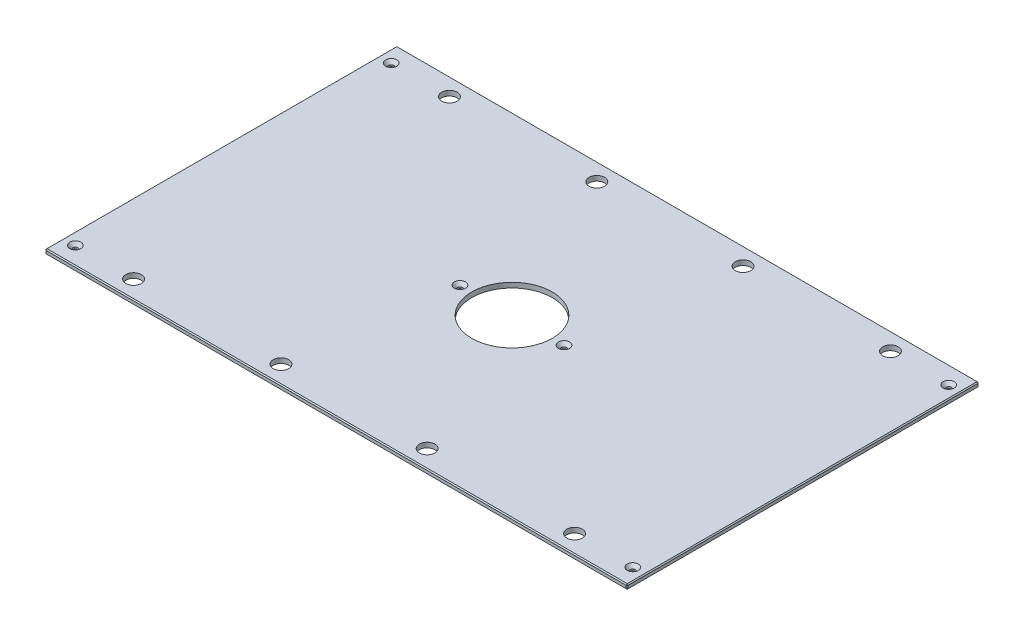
from build123d import *

# Parameters (mm, degrees)
SKETCH1_W                                     = 746.125
SKETCH1_H                                     = 450.85
BOSS_EXTRUDE1_DEPTH                           = 6.35
SKETCH13_R                                    = 51.562
CUT_EXTRUDE6_DEPTH                            = 436.927037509
F_25_32_0_78125_DIAMETER_HOLE1_D              = 19.84375
CHAMFER2_SIZE                                 = 1.27
CSK_FOR_1_4_FLAT_HEAD_MACHINE_SCREW1_AT_COUNT = 2
CSK_FOR_1_4_FLAT_HEAD_MACHINE_SCREW1_AT_PITCH = 404.80996
CSK_FOR_1_4_FLAT_HEAD_MACHINE_SCREW1_2_COUNT  = 2
CSK_FOR_1_4_FLAT_HEAD_MACHINE_SCREW1_2_PITCH  = 821.098498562
CSK_FOR_1_4_FLAT_HEAD_MACHINE_SCREW1_3_COUNT  = 2
CSK_FOR_1_4_FLAT_HEAD_MACHINE_SCREW1_3_PITCH  = 469.709692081
CSK_FOR_1_4_FLAT_HEAD_MACHINE_SCREW1_4_COUNT  = 2
CSK_FOR_1_4_FLAT_HEAD_MACHINE_SCREW1_4_PITCH  = 354.069609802
CSK_FOR_1_4_FLAT_HEAD_MACHINE_SCREW1_5_COUNT  = 2
CSK_FOR_1_4_FLAT_HEAD_MACHINE_SCREW1_5_PITCH  = 714.375
CSK_FOR_1_4_FLAT_HEAD_MACHINE_SCREW1_6_COUNT  = 2
CSK_FOR_1_4_FLAT_HEAD_MACHINE_SCREW1_6_PITCH  = 639.7625
CSK_FOR_1_4_FLAT_HEAD_MACHINE_SCREW1_7_COUNT  = 2
CSK_FOR_1_4_FLAT_HEAD_MACHINE_SCREW1_7_PITCH  = 757.078040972


with BuildPart() as part:
    # Sketch1 → Boss-Extrude1 (new body)
    with BuildSketch(Plane(origin=(0, 0, 0), x_dir=(1, 0, 0), z_dir=(0, 1, 0))):
        Rectangle(SKETCH1_W, SKETCH1_H)
    extrude(amount=BOSS_EXTRUDE1_DEPTH)

    # Sketch13 → Cut-Extrude6 (cut, through all)
    with BuildSketch(Plane(origin=(0, 6.35, 0), x_dir=(1, 0, 0), z_dir=(0, 1, 0))):
        with Locations(Location((0, 0, 0), (0, 0, 270))):
            Circle(SKETCH13_R)
    extrude(amount=-CUT_EXTRUDE6_DEPTH, mode=Mode.SUBTRACT)

    # 25_32 _0.78125_ Diameter Hole1 (through all)
    with Locations(Plane(origin=(0, 6.35, 0), x_dir=(1, 0, 0), z_dir=(0, 1, 0))):
        with Locations((282.575, 202.40498), (-282.575, 202.40498), (282.575, -202.40498), (-282.575, -202.40498), (-93.6625, 202.40498), (93.6625, 202.40498), (93.6625, -202.40498), (-93.6625, -202.40498)):
            Hole(F_25_32_0_78125_DIAMETER_HOLE1_D / 2)

    # Chamfer2
    chamfer2_edges = [part.edges().sort_by_distance(p)[0] for p in [
        (373.0625, 6.35, 0),
        (0, 6.35, -225.425),
        (-373.0625, 6.35, 0),
        (0, 0, -225.425),
        (373.0625, 0, 0),
        (0, 0, 225.425),
        (-373.0625, 0, 0),
        (0, 6.35, 225.425),
        (-373.0625, 3.175, -225.425),
        (373.0625, 3.175, -225.425),
        (373.0625, 3.175, 225.425),
        (-373.0625, 3.175, 225.425),
    ]]
    chamfer(chamfer2_edges, length=CHAMFER2_SIZE)

    # Sketch24 → CSK for 1_4 Flat Head Machine Screw1 (revolve, cut)
    with BuildSketch(Plane(origin=(357.1875, 6.35, -202.40498), x_dir=(0, 0, 1), z_dir=(1, 0, 0))):
        Polygon((0, 0), (0, 6.35), (3.3782, 6.35), (3.3782, 4.324464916), (7.1374, 0), align=None)
    csk_for_1_4_flat_head_machine_screw1 = revolve(axis=Axis((357.1875, 12.7, -202.40498), (0, -1, 0)), mode=Mode.SUBTRACT)

    # CSK for 1_4 Flat Head Machine Screw1 at: CSK for 1_4 Flat Head Machine Screw1 ×2
    with Locations(*[(0, 0, i * CSK_FOR_1_4_FLAT_HEAD_MACHINE_SCREW1_AT_PITCH) for i in range(1, CSK_FOR_1_4_FLAT_HEAD_MACHINE_SCREW1_AT_COUNT)]):
        add(csk_for_1_4_flat_head_machine_screw1, mode=Mode.SUBTRACT)

    # CSK for 1_4 Flat Head Machine Screw1 2: CSK for 1_4 Flat Head Machine Screw1 ×2
    with Locations(*[Vector(-0.8700235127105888, 0, 0.49301023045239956) * (i * CSK_FOR_1_4_FLAT_HEAD_MACHINE_SCREW1_2_PITCH) for i in range(1, CSK_FOR_1_4_FLAT_HEAD_MACHINE_SCREW1_2_COUNT)]):
        add(csk_for_1_4_flat_head_machine_screw1, mode=Mode.SUBTRACT)

    # CSK for 1_4 Flat Head Machine Screw1 3: CSK for 1_4 Flat Head Machine Screw1 ×2
    with Locations(*[Vector(-0.9023924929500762, 0, 0.4309150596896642) * (i * CSK_FOR_1_4_FLAT_HEAD_MACHINE_SCREW1_3_PITCH) for i in range(1, CSK_FOR_1_4_FLAT_HEAD_MACHINE_SCREW1_3_COUNT)]):
        add(csk_for_1_4_flat_head_machine_screw1, mode=Mode.SUBTRACT)

    # CSK for 1_4 Flat Head Machine Screw1 4: CSK for 1_4 Flat Head Machine Screw1 ×2
    with Locations(*[Vector(-0.8204954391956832, 0, 0.5716530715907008) * (i * CSK_FOR_1_4_FLAT_HEAD_MACHINE_SCREW1_4_PITCH) for i in range(1, CSK_FOR_1_4_FLAT_HEAD_MACHINE_SCREW1_4_COUNT)]):
        add(csk_for_1_4_flat_head_machine_screw1, mode=Mode.SUBTRACT)

    # CSK for 1_4 Flat Head Machine Screw1 5: CSK for 1_4 Flat Head Machine Screw1 ×2
    with Locations(*[(-i * CSK_FOR_1_4_FLAT_HEAD_MACHINE_SCREW1_5_PITCH, 0, 0) for i in range(1, CSK_FOR_1_4_FLAT_HEAD_MACHINE_SCREW1_5_COUNT)]):
        add(csk_for_1_4_flat_head_machine_screw1, mode=Mode.SUBTRACT)

    # CSK for 1_4 Flat Head Machine Screw1 6: CSK for 1_4 Flat Head Machine Screw1 ×2
    with Locations(*[(-i * CSK_FOR_1_4_FLAT_HEAD_MACHINE_SCREW1_6_PITCH, 0, 0) for i in range(1, CSK_FOR_1_4_FLAT_HEAD_MACHINE_SCREW1_6_COUNT)]):
        add(csk_for_1_4_flat_head_machine_screw1, mode=Mode.SUBTRACT)

    # CSK for 1_4 Flat Head Machine Screw1 7: CSK for 1_4 Flat Head Machine Screw1 ×2
    with Locations(*[Vector(-0.8450416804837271, 0, 0.5347004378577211) * (i * CSK_FOR_1_4_FLAT_HEAD_MACHINE_SCREW1_7_PITCH) for i in range(1, CSK_FOR_1_4_FLAT_HEAD_MACHINE_SCREW1_7_COUNT)]):
        add(csk_for_1_4_flat_head_machine_screw1, mode=Mode.SUBTRACT)


solid = part.part
